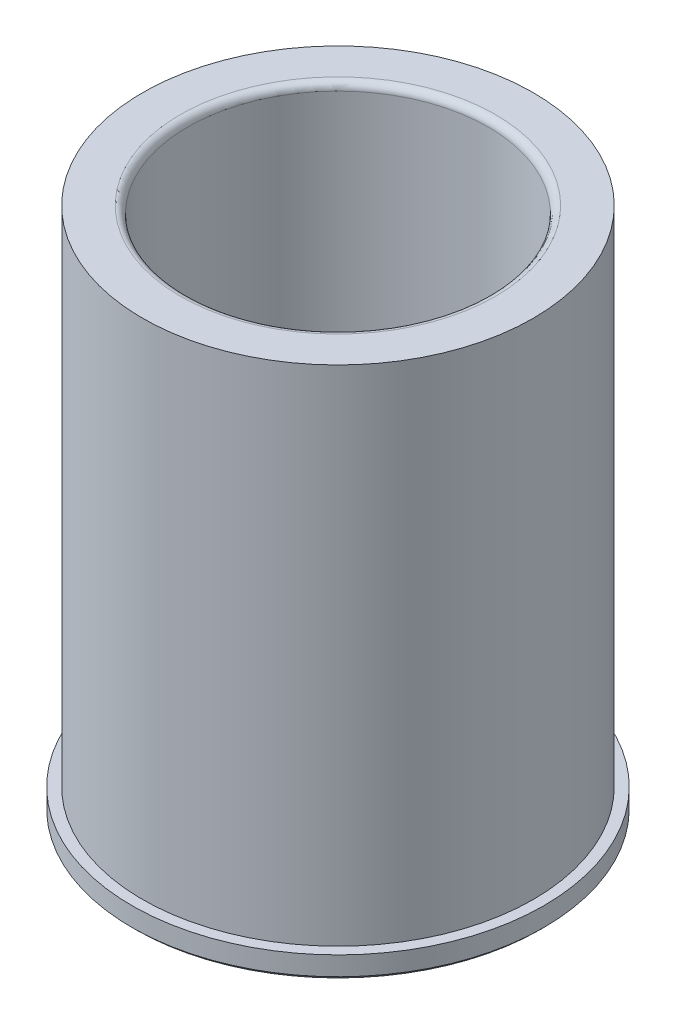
ISO-10303-21;
HEADER;
FILE_DESCRIPTION(('STEP AP214'),'2;1');
FILE_NAME('part.step','',(''),(''),'','','');
FILE_SCHEMA(('AUTOMOTIVE_DESIGN { 1 0 10303 214 1 1 1 1 }'));
ENDSEC;
DATA;
#1=APPLICATION_CONTEXT('core data for automotive mechanical design processes');
#2=APPLICATION_PROTOCOL_DEFINITION('international standard','automotive_design',2000,#1);
#3=PRODUCT_CONTEXT('',#1,'mechanical');
#4=PRODUCT('Part','Part','',(#3));
#5=PRODUCT_RELATED_PRODUCT_CATEGORY('part','',(#4));
#6=PRODUCT_DEFINITION_FORMATION('','',#4);
#7=PRODUCT_DEFINITION_CONTEXT('part definition',#1,'design');
#8=PRODUCT_DEFINITION('design','',#6,#7);
#9=PRODUCT_DEFINITION_SHAPE('','',#8);
#10=(LENGTH_UNIT() NAMED_UNIT(*) SI_UNIT(.MILLI.,.METRE.));
#11=(NAMED_UNIT(*) PLANE_ANGLE_UNIT() SI_UNIT($,.RADIAN.));
#12=(NAMED_UNIT(*) SI_UNIT($,.STERADIAN.) SOLID_ANGLE_UNIT());
#13=UNCERTAINTY_MEASURE_WITH_UNIT(LENGTH_MEASURE(1.E-05),#10,'distance_accuracy_value','');
#14=(GEOMETRIC_REPRESENTATION_CONTEXT(3) GLOBAL_UNCERTAINTY_ASSIGNED_CONTEXT((#13)) GLOBAL_UNIT_ASSIGNED_CONTEXT((#10,
#11,#12)) REPRESENTATION_CONTEXT('',''));
#15=CARTESIAN_POINT('',(0.,0.,0.));
#16=DIRECTION('',(0.,0.,1.));
#17=DIRECTION('',(1.,0.,0.));
#18=AXIS2_PLACEMENT_3D('',#15,#16,#17);
#19=CARTESIAN_POINT('',(3.49148336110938E-12,-1000.,0.));
#20=DIRECTION('',(0.,-1.,0.));
#21=DIRECTION('',(1.,0.,0.));
#22=AXIS2_PLACEMENT_3D('',#19,#20,#21);
#23=CYLINDRICAL_SURFACE('',#22,41.2813499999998);
#24=CARTESIAN_POINT('',(0.,4.76250000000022,0.));
#25=DIRECTION('',(0.,-1.,0.));
#26=DIRECTION('',(1.,0.,0.));
#27=AXIS2_PLACEMENT_3D('',#24,#25,#26);
#28=CIRCLE('',#27,41.28135);
#29=CARTESIAN_POINT('',(41.2813499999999,4.76250000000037,0.));
#30=VERTEX_POINT('',#29);
#31=EDGE_CURVE('E60',#30,#30,#28,.T.);
#32=ORIENTED_EDGE('',*,*,#31,.F.);
#33=EDGE_LOOP('',(#32));
#34=FACE_BOUND('',#33,.T.);
#35=CARTESIAN_POINT('',(-3.87991088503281E-13,111.125,0.));
#36=DIRECTION('',(0.,-1.,0.));
#37=DIRECTION('',(1.,0.,0.));
#38=AXIS2_PLACEMENT_3D('',#35,#36,#37);
#39=CIRCLE('',#38,41.2813499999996);
#40=CARTESIAN_POINT('',(41.2813499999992,111.125,0.));
#41=VERTEX_POINT('',#40);
#42=EDGE_CURVE('E39',#41,#41,#39,.T.);
#43=ORIENTED_EDGE('',*,*,#42,.T.);
#44=EDGE_LOOP('',(#43));
#45=FACE_BOUND('',#44,.T.);
#46=ADVANCED_FACE('F28',(#34,#45),#23,.T.);
#47=CARTESIAN_POINT('',(-41.28135,111.125,0.));
#48=DIRECTION('',(0.,-1.,0.));
#49=DIRECTION('',(1.,0.,0.));
#50=AXIS2_PLACEMENT_3D('',#47,#48,#49);
#51=PLANE('',#50);
#52=CARTESIAN_POINT('',(-3.87991088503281E-13,111.125,0.));
#53=DIRECTION('',(0.,-1.,0.));
#54=DIRECTION('',(1.,0.,0.));
#55=AXIS2_PLACEMENT_3D('',#52,#53,#54);
#56=CIRCLE('',#55,33.2803499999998);
#57=CARTESIAN_POINT('',(33.2803499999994,111.125,0.));
#58=VERTEX_POINT('',#57);
#59=EDGE_CURVE('E35',#58,#58,#56,.T.);
#60=ORIENTED_EDGE('',*,*,#59,.T.);
#61=EDGE_LOOP('',(#60));
#62=FACE_BOUND('',#61,.T.);
#63=ORIENTED_EDGE('',*,*,#42,.F.);
#64=EDGE_LOOP('',(#63));
#65=FACE_BOUND('',#64,.T.);
#66=ADVANCED_FACE('F68',(#62,#65),#51,.F.);
#67=CARTESIAN_POINT('',(3.49148336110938E-12,-1000.,0.));
#68=DIRECTION('',(0.,-1.,0.));
#69=DIRECTION('',(1.,0.,0.));
#70=AXIS2_PLACEMENT_3D('',#67,#68,#69);
#71=CYLINDRICAL_SURFACE('',#70,31.7563499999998);
#72=CARTESIAN_POINT('',(-3.82670067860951E-13,109.601000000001,0.));
#73=DIRECTION('',(0.,-1.,0.));
#74=DIRECTION('',(1.,0.,0.));
#75=AXIS2_PLACEMENT_3D('',#72,#73,#74);
#76=CIRCLE('',#75,31.7563499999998);
#77=CARTESIAN_POINT('',(31.7563499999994,109.601000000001,0.));
#78=VERTEX_POINT('',#77);
#79=EDGE_CURVE('E10',#78,#78,#76,.F.);
#80=ORIENTED_EDGE('',*,*,#79,.T.);
#81=EDGE_LOOP('',(#80));
#82=FACE_BOUND('',#81,.T.);
#83=CARTESIAN_POINT('',(0.,0.761999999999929,0.));
#84=DIRECTION('',(0.,-1.,0.));
#85=DIRECTION('',(1.,0.,0.));
#86=AXIS2_PLACEMENT_3D('',#83,#84,#85);
#87=CIRCLE('',#86,31.75635);
#88=CARTESIAN_POINT('',(31.75635,0.76200000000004,0.));
#89=VERTEX_POINT('',#88);
#90=EDGE_CURVE('E43',#89,#89,#87,.T.);
#91=ORIENTED_EDGE('',*,*,#90,.T.);
#92=EDGE_LOOP('',(#91));
#93=FACE_BOUND('',#92,.T.);
#94=ADVANCED_FACE('F72',(#82,#93),#71,.F.);
#95=CARTESIAN_POINT('',(0.,2.22044604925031E-13,0.));
#96=DIRECTION('',(0.,-1.,0.));
#97=DIRECTION('',(1.,0.,0.));
#98=AXIS2_PLACEMENT_3D('',#95,#96,#97);
#99=CONICAL_SURFACE('',#98,32.51835,0.785398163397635);
#100=ORIENTED_EDGE('',*,*,#90,.F.);
#101=EDGE_LOOP('',(#100));
#102=FACE_BOUND('',#101,.T.);
#103=CARTESIAN_POINT('',(0.,2.22044604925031E-13,0.));
#104=DIRECTION('',(0.,-1.,0.));
#105=DIRECTION('',(1.,0.,0.));
#106=AXIS2_PLACEMENT_3D('',#103,#104,#105);
#107=CIRCLE('',#106,32.51835);
#108=CARTESIAN_POINT('',(32.51835,3.35581882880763E-13,0.));
#109=VERTEX_POINT('',#108);
#110=EDGE_CURVE('E48',#109,#109,#107,.T.);
#111=ORIENTED_EDGE('',*,*,#110,.T.);
#112=EDGE_LOOP('',(#111));
#113=FACE_BOUND('',#112,.T.);
#114=ADVANCED_FACE('F77',(#102,#113),#99,.F.);
#115=CARTESIAN_POINT('',(-32.51835,0.,0.));
#116=DIRECTION('',(0.,1.,0.));
#117=DIRECTION('',(-1.,0.,0.));
#118=AXIS2_PLACEMENT_3D('',#115,#116,#117);
#119=PLANE('',#118);
#120=ORIENTED_EDGE('',*,*,#110,.F.);
#121=EDGE_LOOP('',(#120));
#122=FACE_BOUND('',#121,.T.);
#123=CARTESIAN_POINT('',(0.,2.22044604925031E-13,0.));
#124=DIRECTION('',(0.,-1.,0.));
#125=DIRECTION('',(1.,0.,0.));
#126=AXIS2_PLACEMENT_3D('',#123,#124,#125);
#127=CIRCLE('',#126,42.7609);
#128=CARTESIAN_POINT('',(42.7609,3.71343575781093E-13,0.));
#129=VERTEX_POINT('',#128);
#130=EDGE_CURVE('E51',#129,#129,#127,.T.);
#131=ORIENTED_EDGE('',*,*,#130,.T.);
#132=EDGE_LOOP('',(#131));
#133=FACE_BOUND('',#132,.T.);
#134=ADVANCED_FACE('F82',(#122,#133),#119,.F.);
#135=CARTESIAN_POINT('',(0.,0.762000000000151,0.));
#136=DIRECTION('',(0.,1.,0.));
#137=DIRECTION('',(-1.,0.,0.));
#138=AXIS2_PLACEMENT_3D('',#135,#136,#137);
#139=CONICAL_SURFACE('',#138,43.5229,0.785398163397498);
#140=ORIENTED_EDGE('',*,*,#130,.F.);
#141=EDGE_LOOP('',(#140));
#142=FACE_BOUND('',#141,.T.);
#143=CARTESIAN_POINT('',(0.,0.762000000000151,0.));
#144=DIRECTION('',(0.,-1.,0.));
#145=DIRECTION('',(1.,0.,0.));
#146=AXIS2_PLACEMENT_3D('',#143,#144,#145);
#147=CIRCLE('',#146,43.5229);
#148=CARTESIAN_POINT('',(43.5229,0.762000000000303,0.));
#149=VERTEX_POINT('',#148);
#150=EDGE_CURVE('E54',#149,#149,#147,.T.);
#151=ORIENTED_EDGE('',*,*,#150,.T.);
#152=EDGE_LOOP('',(#151));
#153=FACE_BOUND('',#152,.T.);
#154=ADVANCED_FACE('F86',(#142,#153),#139,.T.);
#155=CARTESIAN_POINT('',(3.49148336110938E-12,-1000.,0.));
#156=DIRECTION('',(0.,-1.,0.));
#157=DIRECTION('',(1.,0.,0.));
#158=AXIS2_PLACEMENT_3D('',#155,#156,#157);
#159=CYLINDRICAL_SURFACE('',#158,43.5229);
#160=ORIENTED_EDGE('',*,*,#150,.F.);
#161=EDGE_LOOP('',(#160));
#162=FACE_BOUND('',#161,.T.);
#163=CARTESIAN_POINT('',(0.,4.76250000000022,0.));
#164=DIRECTION('',(0.,-1.,0.));
#165=DIRECTION('',(1.,0.,0.));
#166=AXIS2_PLACEMENT_3D('',#163,#164,#165);
#167=CIRCLE('',#166,43.5229);
#168=CARTESIAN_POINT('',(43.5229,4.76250000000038,0.));
#169=VERTEX_POINT('',#168);
#170=EDGE_CURVE('E57',#169,#169,#167,.T.);
#171=ORIENTED_EDGE('',*,*,#170,.T.);
#172=EDGE_LOOP('',(#171));
#173=FACE_BOUND('',#172,.T.);
#174=ADVANCED_FACE('F90',(#162,#173),#159,.T.);
#175=CARTESIAN_POINT('',(-43.5229,4.76249999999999,0.));
#176=DIRECTION('',(0.,-1.,0.));
#177=DIRECTION('',(1.,0.,0.));
#178=AXIS2_PLACEMENT_3D('',#175,#176,#177);
#179=PLANE('',#178);
#180=ORIENTED_EDGE('',*,*,#170,.F.);
#181=EDGE_LOOP('',(#180));
#182=FACE_BOUND('',#181,.T.);
#183=ORIENTED_EDGE('',*,*,#31,.T.);
#184=EDGE_LOOP('',(#183));
#185=FACE_BOUND('',#184,.T.);
#186=ADVANCED_FACE('F64',(#182,#185),#179,.F.);
#187=CARTESIAN_POINT('',(-3.8267006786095E-13,109.601,0.));
#188=DIRECTION('',(0.,-1.,0.));
#189=DIRECTION('',(1.,0.,0.));
#190=AXIS2_PLACEMENT_3D('',#187,#188,#189);
#191=TOROIDAL_SURFACE('',#190,33.2803499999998,1.524);
#192=ORIENTED_EDGE('',*,*,#79,.F.);
#193=EDGE_LOOP('',(#192));
#194=FACE_BOUND('',#193,.T.);
#195=ORIENTED_EDGE('',*,*,#59,.F.);
#196=EDGE_LOOP('',(#195));
#197=FACE_BOUND('',#196,.T.);
#198=ADVANCED_FACE('F30',(#194,#197),#191,.T.);
#199=CLOSED_SHELL('',(#46,#66,#94,#114,#134,#154,#174,#186,#198));
#200=MANIFOLD_SOLID_BREP('B2',#199);
#201=ADVANCED_BREP_SHAPE_REPRESENTATION('',(#18,#200),#14);
#202=SHAPE_DEFINITION_REPRESENTATION(#9,#201);
ENDSEC;
END-ISO-10303-21;
